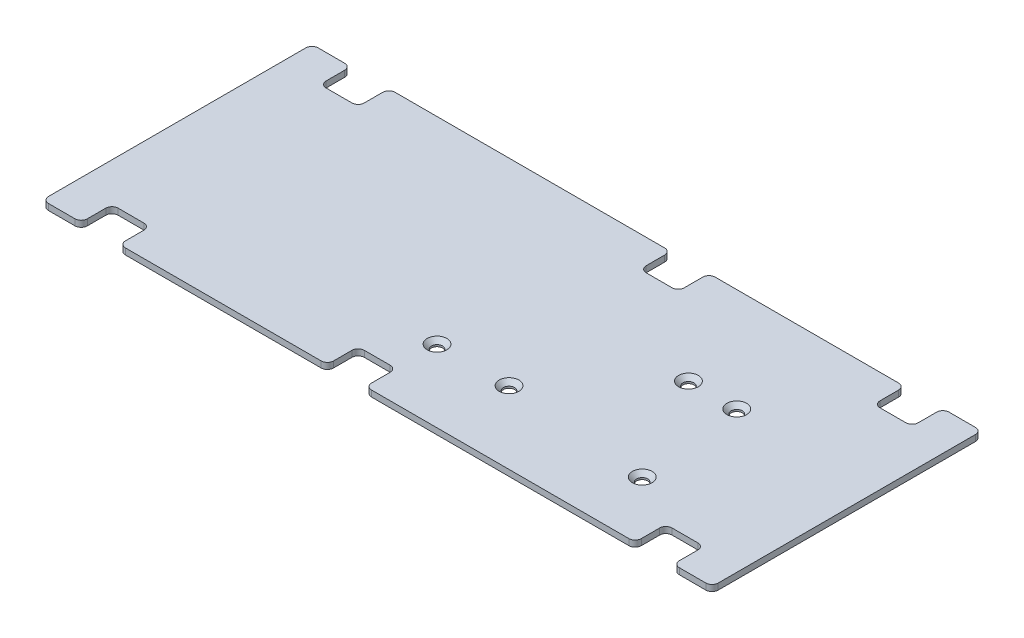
from build123d import *

# Parameters (mm, degrees)
EXTRUDE_1_DEPTH                = 1
HOLE_WIZARD_M1_6_1_D           = 1.8
HOLE_WIZARD_M1_6_1_DEPTH       = 4.25
HOLE_WIZARD_M1_6_1_CSINK_D     = 3.2
HOLE_WIZARD_M1_6_1_CSINK_ANGLE = 90
HOLE_WIZARD_M1_6_1_TIP         = 0.540774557


with BuildPart() as part:
    # Sketch 1 → Extrude 1 (new body)
    with BuildSketch(Plane(origin=(0, 0, 0), x_dir=(1, 0, 0), z_dir=(0, 1, 0))):
        with BuildLine():
            Line((252.806588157, 0.6), (211.006587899, 0.6))
            ThreePointArc((211.006587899, 0.6), (210.299481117, 0.892893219), (210.006587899, 1.6))
            Line((210.006587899, 1.6), (210.006587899, 4.599993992))
            ThreePointArc((210.006587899, 4.599993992), (209.71369468, 5.307100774), (209.006587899, 5.599993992))
            Line((209.006587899, 5.599993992), (204.806588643, 5.599993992))
            ThreePointArc((204.806588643, 5.599993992), (204.099481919, 5.307100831), (203.806588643, 4.599994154))
            Line((203.806588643, 4.599994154), (203.806588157, 1.599999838))
            ThreePointArc((203.806588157, 1.599999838), (203.513694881, 0.892893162), (202.806588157, 0.6))
            Line((202.806588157, 0.6), (171.006587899, 0.6))
            ThreePointArc((171.006587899, 0.6), (170.299481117, 0.892893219), (170.006587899, 1.6))
            Line((170.006587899, 1.6), (170.006587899, 4.599993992))
            ThreePointArc((170.006587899, 4.599993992), (169.71369468, 5.307100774), (169.006587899, 5.599993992))
            Line((169.006587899, 5.599993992), (164.806588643, 5.599993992))
            ThreePointArc((164.806588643, 5.599993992), (164.099481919, 5.307100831), (163.806588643, 4.599994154))
            Line((163.806588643, 4.599994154), (163.806588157, 1.599999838))
            ThreePointArc((163.806588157, 1.599999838), (163.513694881, 0.892893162), (162.806588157, 0.6))
            Line((162.806588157, 0.6), (158.506587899, 0.6))
            ThreePointArc((158.506587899, 0.6), (157.799481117, 0.892893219), (157.506587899, 1.6))
            Line((157.506587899, 1.6), (157.506587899, 43.4))
            ThreePointArc((157.506587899, 43.4), (157.799481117, 44.107106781), (158.506587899, 44.4))
            Line((158.506587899, 44.4), (162.806588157, 44.4))
            ThreePointArc((162.806588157, 44.4), (163.513694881, 44.107106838), (163.806588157, 43.400000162))
            Line((163.806588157, 43.400000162), (163.806588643, 40.400005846))
            ThreePointArc((163.806588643, 40.400005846), (164.099481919, 39.692899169), (164.806588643, 39.400006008))
            Line((164.806588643, 39.400006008), (169.006587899, 39.400006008))
            ThreePointArc((169.006587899, 39.400006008), (169.71369468, 39.692899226), (170.006587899, 40.400006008))
            Line((170.006587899, 40.400006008), (170.006587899, 43.4))
            ThreePointArc((170.006587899, 43.4), (170.299481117, 44.107106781), (171.006587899, 44.4))
            Line((171.006587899, 44.4), (214.806588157, 44.4))
            ThreePointArc((214.806588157, 44.4), (215.513694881, 44.107106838), (215.806588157, 43.400000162))
            Line((215.806588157, 43.400000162), (215.806588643, 40.400005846))
            ThreePointArc((215.806588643, 40.400005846), (216.099481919, 39.692899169), (216.806588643, 39.400006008))
            Line((216.806588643, 39.400006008), (221.006587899, 39.400006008))
            ThreePointArc((221.006587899, 39.400006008), (221.71369468, 39.692899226), (222.006587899, 40.400006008))
            Line((222.006587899, 40.400006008), (222.006587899, 43.4))
            ThreePointArc((222.006587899, 43.4), (222.299481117, 44.107106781), (223.006587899, 44.4))
            Line((223.006587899, 44.4), (252.806588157, 44.4))
            ThreePointArc((252.806588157, 44.4), (253.513694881, 44.107106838), (253.806588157, 43.400000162))
            Line((253.806588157, 43.400000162), (253.806588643, 40.400005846))
            ThreePointArc((253.806588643, 40.400005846), (254.099481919, 39.692899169), (254.806588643, 39.400006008))
            Line((254.806588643, 39.400006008), (259.006587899, 39.400006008))
            ThreePointArc((259.006587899, 39.400006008), (259.71369468, 39.692899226), (260.006587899, 40.400006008))
            Line((260.006587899, 40.400006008), (260.006587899, 43.4))
            ThreePointArc((260.006587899, 43.4), (260.299481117, 44.107106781), (261.006587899, 44.4))
            Line((261.006587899, 44.4), (265.306587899, 44.4))
            ThreePointArc((265.306587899, 44.4), (266.01369468, 44.107106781), (266.306587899, 43.4))
            Line((266.306587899, 43.4), (266.306587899, 1.6))
            ThreePointArc((266.306587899, 1.6), (266.01369468, 0.892893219), (265.306587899, 0.6))
            Line((265.306587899, 0.6), (261.006587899, 0.6))
            ThreePointArc((261.006587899, 0.6), (260.299481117, 0.892893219), (260.006587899, 1.6))
            Line((260.006587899, 1.6), (260.006587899, 4.599993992))
            ThreePointArc((260.006587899, 4.599993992), (259.71369468, 5.307100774), (259.006587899, 5.599993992))
            Line((259.006587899, 5.599993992), (254.806588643, 5.599993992))
            ThreePointArc((254.806588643, 5.599993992), (254.099481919, 5.307100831), (253.806588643, 4.599994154))
            Line((253.806588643, 4.599994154), (253.806588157, 1.599999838))
            ThreePointArc((253.806588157, 1.599999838), (253.513694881, 0.892893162), (252.806588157, 0.6))
        make_face()
    extrude(amount=EXTRUDE_1_DEPTH)

    # Hole Wizard M1.6 _1
    with Locations(Plane(origin=(0, 1, 0), x_dir=(1, 0, 0), z_dir=(0, 1, 0))):
        with Locations((209.849913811, 12.375), (221.549913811, 12.375), (235.474913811, 27.6), (243.324913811, 27.6), (245.224913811, 10.337157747)):
            CounterSinkHole(HOLE_WIZARD_M1_6_1_D / 2, HOLE_WIZARD_M1_6_1_CSINK_D / 2, depth=HOLE_WIZARD_M1_6_1_DEPTH, counter_sink_angle=HOLE_WIZARD_M1_6_1_CSINK_ANGLE)
            with Locations((0, 0, -(HOLE_WIZARD_M1_6_1_DEPTH + HOLE_WIZARD_M1_6_1_TIP / 2))):  # 118° drill point
                Cone(0, HOLE_WIZARD_M1_6_1_D / 2, HOLE_WIZARD_M1_6_1_TIP, mode=Mode.SUBTRACT)


solid = part.part
